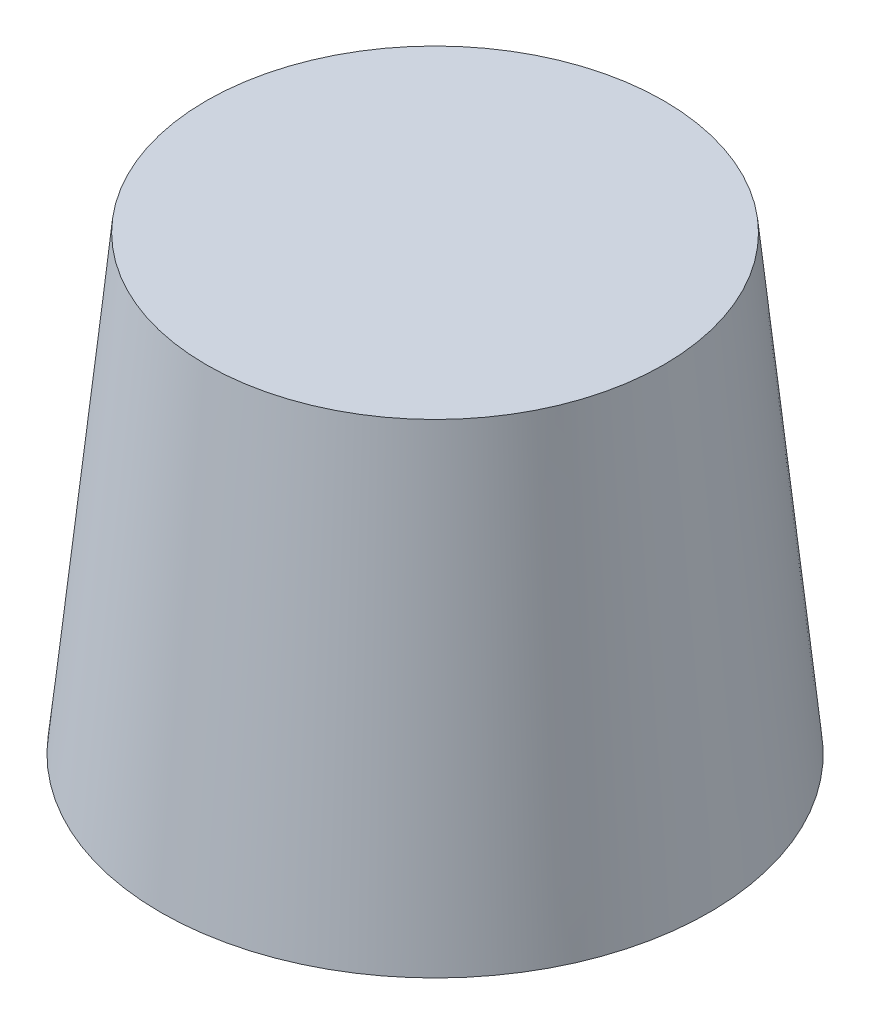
ISO-10303-21;
HEADER;
FILE_DESCRIPTION(('STEP AP214'),'2;1');
FILE_NAME('part.step','',(''),(''),'','','');
FILE_SCHEMA(('AUTOMOTIVE_DESIGN { 1 0 10303 214 1 1 1 1 }'));
ENDSEC;
DATA;
#1=APPLICATION_CONTEXT('core data for automotive mechanical design processes');
#2=APPLICATION_PROTOCOL_DEFINITION('international standard','automotive_design',2000,#1);
#3=PRODUCT_CONTEXT('',#1,'mechanical');
#4=PRODUCT('Part','Part','',(#3));
#5=PRODUCT_RELATED_PRODUCT_CATEGORY('part','',(#4));
#6=PRODUCT_DEFINITION_FORMATION('','',#4);
#7=PRODUCT_DEFINITION_CONTEXT('part definition',#1,'design');
#8=PRODUCT_DEFINITION('design','',#6,#7);
#9=PRODUCT_DEFINITION_SHAPE('','',#8);
#10=(LENGTH_UNIT() NAMED_UNIT(*) SI_UNIT(.MILLI.,.METRE.));
#11=(NAMED_UNIT(*) PLANE_ANGLE_UNIT() SI_UNIT($,.RADIAN.));
#12=(NAMED_UNIT(*) SI_UNIT($,.STERADIAN.) SOLID_ANGLE_UNIT());
#13=UNCERTAINTY_MEASURE_WITH_UNIT(LENGTH_MEASURE(1.E-05),#10,'distance_accuracy_value','');
#14=(GEOMETRIC_REPRESENTATION_CONTEXT(3) GLOBAL_UNCERTAINTY_ASSIGNED_CONTEXT((#13)) GLOBAL_UNIT_ASSIGNED_CONTEXT((#10,
#11,#12)) REPRESENTATION_CONTEXT('',''));
#15=CARTESIAN_POINT('',(0.,0.,0.));
#16=DIRECTION('',(0.,0.,1.));
#17=DIRECTION('',(1.,0.,0.));
#18=AXIS2_PLACEMENT_3D('',#15,#16,#17);
#19=CARTESIAN_POINT('',(0.,0.,0.));
#20=DIRECTION('',(0.,1.,0.));
#21=DIRECTION('',(0.,0.,1.));
#22=AXIS2_PLACEMENT_3D('',#19,#20,#21);
#23=PLANE('',#22);
#24=CARTESIAN_POINT('',(0.,0.,0.));
#25=DIRECTION('',(0.,1.,0.));
#26=DIRECTION('',(0.,0.,1.));
#27=AXIS2_PLACEMENT_3D('',#24,#25,#26);
#28=CIRCLE('',#27,90.);
#29=CARTESIAN_POINT('',(0.,0.,90.));
#30=VERTEX_POINT('',#29);
#31=EDGE_CURVE('E11',#30,#30,#28,.T.);
#32=ORIENTED_EDGE('',*,*,#31,.F.);
#33=EDGE_LOOP('',(#32));
#34=FACE_BOUND('',#33,.T.);
#35=ADVANCED_FACE('F36',(#34),#23,.F.);
#36=CARTESIAN_POINT('',(0.,148.,0.));
#37=DIRECTION('',(0.,1.,0.));
#38=DIRECTION('',(0.,0.,1.));
#39=AXIS2_PLACEMENT_3D('',#36,#37,#38);
#40=PLANE('',#39);
#41=CARTESIAN_POINT('',(0.,148.,0.));
#42=DIRECTION('',(0.,1.,0.));
#43=DIRECTION('',(0.,0.,1.));
#44=AXIS2_PLACEMENT_3D('',#41,#42,#43);
#45=CIRCLE('',#44,75.);
#46=CARTESIAN_POINT('',(0.,148.,75.));
#47=VERTEX_POINT('',#46);
#48=EDGE_CURVE('E44',#47,#47,#45,.T.);
#49=ORIENTED_EDGE('',*,*,#48,.T.);
#50=EDGE_LOOP('',(#49));
#51=FACE_BOUND('',#50,.T.);
#52=ADVANCED_FACE('F68',(#51),#40,.T.);
#53=CARTESIAN_POINT('',(0.,148.,0.));
#54=DIRECTION('',(0.,-1.,0.));
#55=DIRECTION('',(0.,0.,-1.));
#56=AXIS2_PLACEMENT_3D('',#53,#54,#55);
#57=CONICAL_SURFACE('',#56,75.,0.101006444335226);
#58=ORIENTED_EDGE('',*,*,#48,.F.);
#59=EDGE_LOOP('',(#58));
#60=FACE_BOUND('',#59,.T.);
#61=ORIENTED_EDGE('',*,*,#31,.T.);
#62=EDGE_LOOP('',(#61));
#63=FACE_BOUND('',#62,.T.);
#64=ADVANCED_FACE('F76',(#60,#63),#57,.T.);
#65=CLOSED_SHELL('',(#35,#52,#64));
#66=MANIFOLD_SOLID_BREP('B2',#65);
#67=ADVANCED_BREP_SHAPE_REPRESENTATION('',(#18,#66),#14);
#68=SHAPE_DEFINITION_REPRESENTATION(#9,#67);
ENDSEC;
END-ISO-10303-21;
